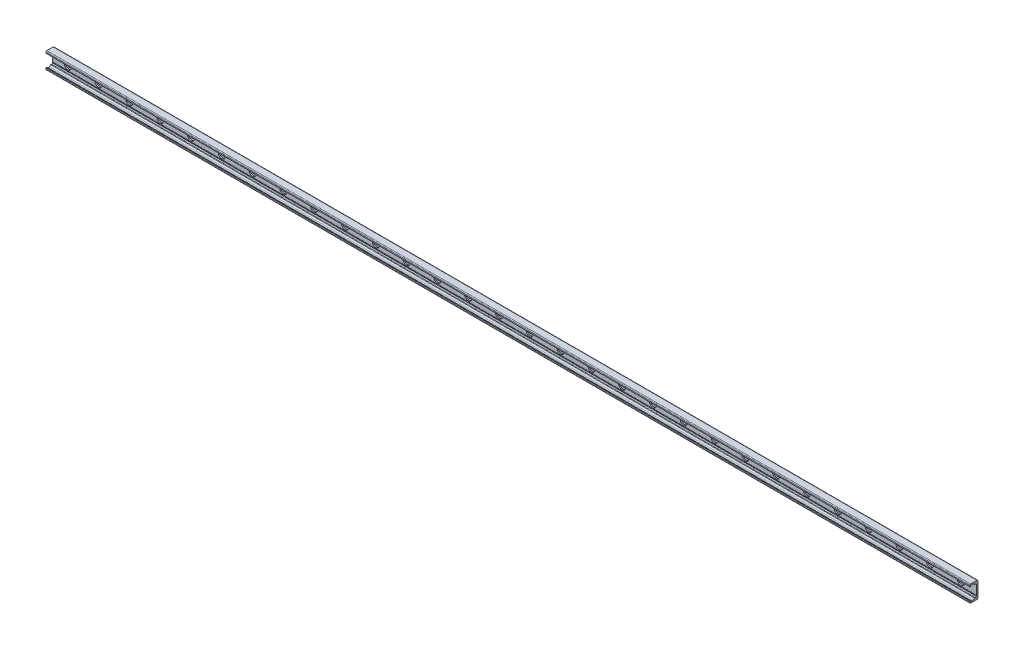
from build123d import *

# Parameters (mm, degrees)
BOSS_EXTRUDE1_DEPTH = 1200
SKETCH2_R           = 9
SKETCH2_R_2         = 4.5
CUT_EXTRUDE1_DEPTH  = 3.1
SKETCH2_2_R         = 4.5
CUT_EXTRUDE2_DEPTH  = 1201.306002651
LPATTERN1_COUNT     = 30
LPATTERN1_PITCH     = 80


with BuildPart() as part:
    # Sketch1 → Boss-Extrude1 (new, symmetric)
    with BuildSketch(Plane(origin=(0, 0, 0), x_dir=(0, 0, -1), z_dir=(1, 0, 0))):
        with BuildLine():
            Line((0, 0), (0, 19))
            ThreePointArc((0, 19), (-0.732233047, 20.767766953), (-2.5, 21.5))
            Line((-2.5, 21.5), (-19, 21.5))
            ThreePointArc((-19, 21.5), (-20.414213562, 20.914213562), (-21, 19.5))
            Line((-21, 19.5), (-21, 16.625057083))
            ThreePointArc((-21, 16.625057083), (-20.553251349, 15.888838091), (-19.693931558, 15.945160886))
            Line((-19.693931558, 15.945160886), (-16.794305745, 17.975500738))
            ThreePointArc((-16.794305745, 17.975500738), (-14.5, 18.69889256), (-12.205694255, 17.975500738))
            Line((-12.205694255, 17.975500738), (-8.829831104, 15.611695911))
            ThreePointArc((-8.829831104, 15.611695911), (-8.28408983, 15.342566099), (-7.682678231, 15.25))
            Line((-7.682678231, 15.25), (-6.5, 15.25))
            ThreePointArc((-6.5, 15.25), (-5.085786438, 14.664213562), (-4.5, 13.25))
            Line((-4.5, 13.25), (-4.5, -10.75))
            ThreePointArc((-4.5, -10.75), (-4.25, -11), (-4.5, -11.25))
            Line((-4.5, -11.25), (-4.5, -12.25))
            ThreePointArc((-4.5, -12.25), (-4.25, -12.5), (-4.5, -12.75))
            Line((-4.5, -12.75), (-4.5, -13.25))
            ThreePointArc((-4.5, -13.25), (-5.085786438, -14.664213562), (-6.5, -15.25))
            Line((-6.5, -15.25), (-7.682678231, -15.25))
            ThreePointArc((-7.682678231, -15.25), (-8.28408983, -15.342566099), (-8.829831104, -15.611695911))
            Line((-8.829831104, -15.611695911), (-12.205694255, -17.975500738))
            ThreePointArc((-12.205694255, -17.975500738), (-14.5, -18.69889256), (-16.794305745, -17.975500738))
            Line((-16.794305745, -17.975500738), (-19.693931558, -15.945160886))
            ThreePointArc((-19.693931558, -15.945160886), (-20.553251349, -15.888838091), (-21, -16.625057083))
            Line((-21, -16.625057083), (-21, -19.5))
            ThreePointArc((-21, -19.5), (-20.414213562, -20.914213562), (-19, -21.5))
            Line((-19, -21.5), (-2.5, -21.5))
            ThreePointArc((-2.5, -21.5), (-0.732233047, -20.767766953), (0, -19))
            Line((0, -19), (0, 0))
        make_face()
    extrude(amount=BOSS_EXTRUDE1_DEPTH, both=True)

    # Sketch2 → Cut-Extrude1 (cut)
    with BuildSketch(Plane.XY.offset(4.5)):
        with Locations((1160, 0)):
            Circle(SKETCH2_R)
        with Locations((1160, 0)):
            Circle(SKETCH2_R_2, mode=Mode.SUBTRACT)
    cut_extrude1 = extrude(amount=-CUT_EXTRUDE1_DEPTH, mode=Mode.SUBTRACT)

    # Sketch2_2 → Cut-Extrude2 (cut, through all)
    with BuildSketch(Plane.XY.offset(4.5)):
        with Locations((1160, 0)):
            Circle(SKETCH2_2_R)
    cut_extrude2 = extrude(amount=-CUT_EXTRUDE2_DEPTH, mode=Mode.SUBTRACT)

    # LPattern1: Cut-Extrude1, Cut-Extrude2 ×30
    with Locations(*[(-i * LPATTERN1_PITCH, 0, 0) for i in range(1, LPATTERN1_COUNT)]):
        add(cut_extrude1, mode=Mode.SUBTRACT)
        add(cut_extrude2, mode=Mode.SUBTRACT)


solid = part.part
